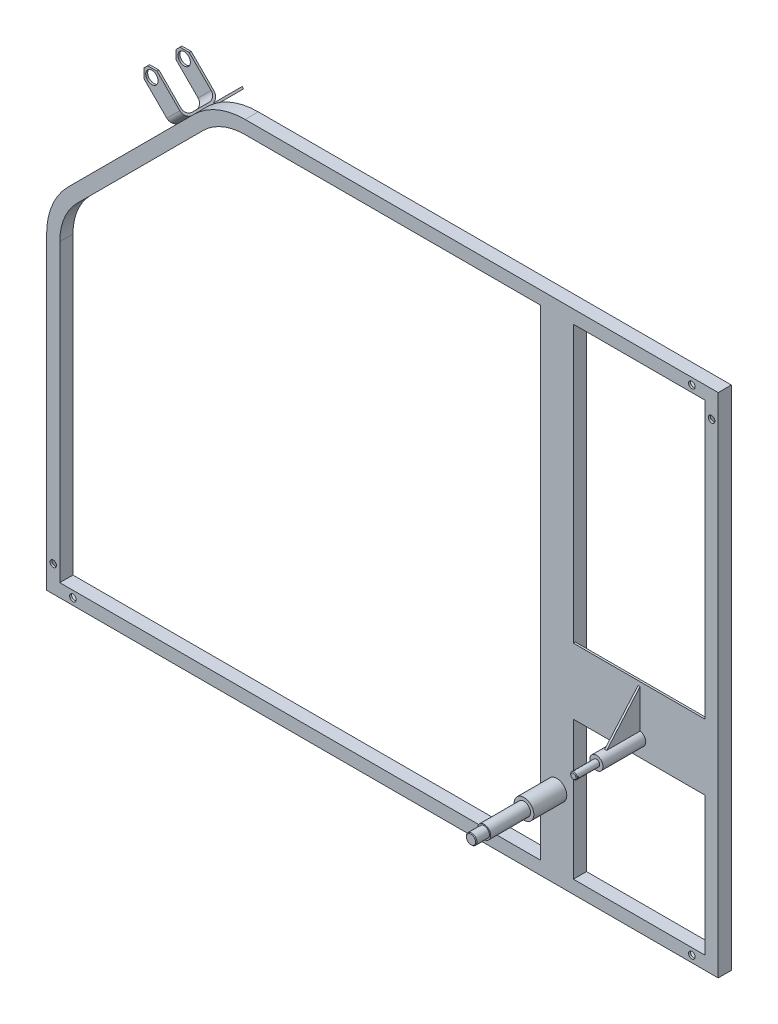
from build123d import *

# Parameters (mm, degrees)
ESQUISSE2_W                  = 20
ESQUISSE2_H                  = 20
ESQUISSE2_W_2                = 14
ESQUISSE2_H_2                = 14
EXTRUSION1_REACH             = 1260.054
ESQUISSE3_W                  = 50
ESQUISSE3_H                  = 20
ESQUISSE3_W_2                = 44
ESQUISSE3_H_2                = 14
EXTRUSION2_REACH             = 1258.065
ESQUISSE4_W                  = 20
ESQUISSE4_H                  = 50
ESQUISSE4_W_2                = 14
ESQUISSE4_H_2                = 44
ESQUISSE5_R                  = 15
EXTRUSION3_DEPTH             = 50
ESQUISSE6_R                  = 10
EXTRUSION4_DEPTH             = 60.5
ESQUISSE7_R                  = 8
EXTRUSION5_DEPTH             = 20
EXTRUSION6_REACH             = 1265.859
ESQUISSE8_W                  = 3
ESQUISSE8_H                  = 50
ESQUISSE9_R                  = 10
EXTRUSION7_DEPTH             = 65
ESQUISSE10_R                 = 5
EXTRUSION8_DEPTH             = 35
EXTRUSION9_DEPTH             = 13
EXTRUSION9_DEPTH_BACK        = 15
CHANFREIN1_SIZE              = 10
ESQUISSE13_R                 = 9.403986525
ENL_V_MAT_EXTRU_1_DEPTH      = 1283.476129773
EXTRUSION10_DEPTH            = 51
ESQUISSE15_R                 = 3.5
ENL_V_MAT_EXTRU_2_DEPTH      = 1091.887932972
NERVURE9_REACH               = 1196.296
ESQUISSE16_WALL_W            = 2490.623643
ESQUISSE16_WALL_H            = 3
ESQUISSE17_R                 = 5
ENL_V_MAT_EXTRU_3_DEPTH      = 1279.300834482
ESQUISSE18_R                 = 4.903594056
ENL_V_MAT_EXTRU_4_DEPTH      = 1281.497178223
CHANFREIN2_SIZE              = 1
CHANFREIN3_SIZE              = 1
ENL_V_MAT_EXTRU_5_DEPTH      = 14
ENL_V_MAT_EXTRU_5_DEPTH_BACK = 14
ESQUISSE19_R                 = 0.75


with BuildPart() as part:
    # Balayage1: sweep along a path in Esquisse1
    with BuildLine(Plane.XY) as balayage1_path:
        Line((0, 0), (-1000, 0))
        Line((-1000, 0), (-1000, 458.578643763))
        ThreePointArc((-1000, 458.578643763), (-992.387953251, 496.846986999), (-970.710678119, 529.289321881))
        Line((-970.710678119, 529.289321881), (-779.289321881, 720.710678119))
        ThreePointArc((-779.289321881, 720.710678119), (-746.846986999, 742.387953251), (-708.578643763, 750))
        Line((-708.578643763, 750), (0, 750))
        Line((0, 750), (0, 0))
    # Esquisse2 → Balayage1 (sweep)
    with BuildSketch(Plane(origin=(0, 0, 0), x_dir=(0, 0, -1), z_dir=(1, 0, 0))):
        Rectangle(ESQUISSE2_W, ESQUISSE2_H)
        Rectangle(ESQUISSE2_W_2, ESQUISSE2_H_2, mode=Mode.SUBTRACT)
    sweep(path=balayage1_path.line, transition=Transition.RIGHT)

    # Esquisse3 → Extrusion1 (add, up to next)
    with BuildSketch(Plane.XZ.offset(-740), mode=Mode.PRIVATE) as extrusion1_sk1:
        with Locations((-235, 0)):
            Rectangle(ESQUISSE3_W, ESQUISSE3_H)
        with Locations((-235, 0)):
            Rectangle(ESQUISSE3_W_2, ESQUISSE3_H_2, mode=Mode.SUBTRACT)
    extrusion1_tool1 = extrude(extrusion1_sk1.sketch, amount=EXTRUSION1_REACH, mode=Mode.PRIVATE) - part.part
    add(extrusion1_tool1.solids().sort_by_distance((-235, 740, 9.461484))[0])

    # Esquisse4 → Extrusion2 (add, up to next)
    with BuildSketch(Plane.ZY.offset(10), mode=Mode.PRIVATE) as extrusion2_sk1:
        with Locations((0, 245.45562568)):
            Rectangle(ESQUISSE4_W, ESQUISSE4_H)
        with Locations((0, 245.45562568)):
            Rectangle(ESQUISSE4_W_2, ESQUISSE4_H_2, mode=Mode.SUBTRACT)
    extrusion2_tool1 = extrude(extrusion2_sk1.sketch, amount=EXTRUSION2_REACH, mode=Mode.PRIVATE) - part.part
    add(extrusion2_tool1.solids().sort_by_distance((-10, 269.917109, 0))[0])

    # Esquisse5 → Extrusion3 (add)
    with BuildSketch(Plane.XY.offset(10)):
        with Locations((-235, 115)):
            Circle(ESQUISSE5_R)
    extrude(amount=EXTRUSION3_DEPTH)

    # Esquisse6 → Extrusion4 (add)
    with BuildSketch(Plane.XY.offset(60)):
        with Locations((-235, 115)):
            Circle(ESQUISSE6_R)
    extrude(amount=EXTRUSION4_DEPTH)

    # Esquisse7 → Extrusion5 (add)
    with BuildSketch(Plane.XY.offset(120.5)):
        with Locations((-235, 115)):
            Circle(ESQUISSE7_R)
    extrude(amount=EXTRUSION5_DEPTH)

    # Esquisse8 → Extrusion6 (add, up to next)
    with BuildSketch(Plane.ZY.offset(10), mode=Mode.PRIVATE) as extrusion6_sk1:
        with Locations((8.5, 295.45562568)):
            Rectangle(ESQUISSE8_W, ESQUISSE8_H)
    extrusion6_tool1 = extrude(extrusion6_sk1.sketch, amount=EXTRUSION6_REACH, mode=Mode.PRIVATE) - part.part
    add(extrusion6_tool1.solids().sort_by_distance((-10, 295.455626, 8.5))[0])

    # Esquisse9 → Extrusion7 (add)
    with BuildSketch(Plane.XY.offset(10)):
        with Locations((-110, 245.45562568)):
            Circle(ESQUISSE9_R)
    extrude(amount=EXTRUSION7_DEPTH)

    # Esquisse10 → Extrusion8 (add)
    with BuildSketch(Plane.XY.offset(75)):
        with Locations((-110, 245.45562568)):
            Circle(ESQUISSE10_R)
    extrude(amount=EXTRUSION8_DEPTH)

    # Esquisse12 → Extrusion9 (add, two sides: drawn at the far end of the back side and taken through both)
    with BuildSketch(Plane(origin=(-36.082088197, -36.082088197, 0), x_dir=(0, 0, -1), z_dir=(0.7071067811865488, 0.7071067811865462, -2.6360787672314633e-15)).offset(-EXTRUSION9_DEPTH_BACK)):
        with BuildLine():
            Line((26, 1140.66017178), (26, 1081.66017178))
            ThreePointArc((26, 1081.66017178), (22.778174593, 1073.881997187), (15, 1070.66017178))
            Line((15, 1070.66017178), (-15, 1070.66017178))
            ThreePointArc((-15, 1070.66017178), (-22.778174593, 1073.881997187), (-26, 1081.66017178))
            Line((-26, 1081.66017178), (-26, 1140.66017178))
            Line((-26, 1140.66017178), (-23, 1140.66017178))
            Line((-23, 1140.66017178), (-23, 1083.66017178))
            ThreePointArc((-23, 1083.66017178), (-20.071067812, 1076.589103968), (-13, 1073.66017178))
            Line((-13, 1073.66017178), (13, 1073.66017178))
            ThreePointArc((13, 1073.66017178), (20.071067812, 1076.589103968), (23, 1083.66017178))
            Line((23, 1083.66017178), (23, 1140.66017178))
            Line((23, 1140.66017178), (26, 1140.66017178))
        make_face()
    extrude(amount=EXTRUSION9_DEPTH + EXTRUSION9_DEPTH_BACK)

    # Chanfrein1
    chanfrein1_edges = [part.edges().sort_by_distance(p)[0] for p in [
        (-853.257232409, 759.879852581, -24.5),
        (-853.257232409, 759.879852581, 24.5),
        (-833.458242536, 779.678842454, -24.5),
        (-833.458242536, 779.678842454, 24.5),
    ]]
    chamfer(chanfrein1_edges, length=CHANFREIN1_SIZE)

    # Esquisse13 → Enl_v. mat.-Extru.1 (cut, through all)
    with BuildSketch(Plane(origin=(0, 0, -26), x_dir=(-1, 0, 0), z_dir=(0, 0, -1))):
        with Locations((834.083899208, 760.466493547)):
            Circle(ESQUISSE13_R)
    extrude(amount=-ENL_V_MAT_EXTRU_1_DEPTH, mode=Mode.SUBTRACT)

    # Esquisse14 → Extrusion10 (add)
    with BuildSketch(Plane(origin=(0, 0, -10), x_dir=(-1, 0, 0), z_dir=(0, 0, -1))):
        Polygon((783.960767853, 730.181367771), (781.839447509, 728.060047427), (801.638437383, 708.261057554), (803.759757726, 710.382377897), align=None)
    extrude(amount=EXTRUSION10_DEPTH)

    # Esquisse15 → Enl_v. mat.-Extru.2 (cut, through all)
    with BuildSketch(Plane(origin=(-754.949747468, 754.949747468, 0), x_dir=(0, 0, -1), z_dir=(0.7071067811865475, -0.7071067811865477, 0))):
        with Locations(Location((41, -51.027778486, 0), (0, 0, 90))):
            Circle(ESQUISSE15_R)
    extrude(amount=-ENL_V_MAT_EXTRU_2_DEPTH, mode=Mode.SUBTRACT)

    # Esquisse16 wall → Nervure9 (add, up to next)
    with BuildSketch(Plane(origin=(-110.1776504, 289.015981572, 31.611392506), x_dir=(0, -0.756370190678, 0.65414381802), z_dir=(0, -0.65414381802, -0.756370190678)), mode=Mode.PRIVATE) as nervure9_sk1:
        Rectangle(ESQUISSE16_WALL_W, ESQUISSE16_WALL_H)
    nervure9_tool1 = extrude(nervure9_sk1.sketch, amount=NERVURE9_REACH, mode=Mode.PRIVATE) - part.part
    add(nervure9_tool1.solids().sort_by_distance((-110.1776504, 289.015981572, 31.611392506))[0])

    # Esquisse17 → Enl_v. mat.-Extru.3 (cut, through all)
    with BuildSketch(Plane.XY.offset(10)):
        with Locations((-30, 750)):
            Circle(ESQUISSE17_R)
        with Locations((-970, 0)):
            Circle(ESQUISSE17_R)
        with Locations((0, 720)):
            Circle(ESQUISSE17_R)
        with Locations((-30, 0)):
            Circle(ESQUISSE17_R)
    extrude(amount=-ENL_V_MAT_EXTRU_3_DEPTH, mode=Mode.SUBTRACT)

    # Esquisse18 → Enl_v. mat.-Extru.4 (cut, through all)
    with BuildSketch(Plane(origin=(0, 0, -10), x_dir=(-1, 0, 0), z_dir=(0, 0, -1))):
        with Locations((1000, 30)):
            Circle(ESQUISSE18_R)
    extrude(amount=-ENL_V_MAT_EXTRU_4_DEPTH, mode=Mode.SUBTRACT)

    # Chanfrein2
    chanfrein2_edges = [part.edges().sort_by_distance(p)[0] for p in [
        (-243, 115, 140.5),
    ]]
    chamfer(chanfrein2_edges, length=CHANFREIN2_SIZE)

    # Chanfrein3
    chanfrein3_edges = [part.edges().sort_by_distance(p)[0] for p in [
        (-115, 245.45562568, 110),
    ]]
    chamfer(chanfrein3_edges, length=CHANFREIN3_SIZE)

    # Esquisse19 → Enl_v. mat.-Extru.5 (cut, two sides: drawn at the far end of the back side and taken through both)
    with BuildSketch(Plane(origin=(-108.6776504, 0, 0), x_dir=(0, 0, -1), z_dir=(1, 0, 0)).offset(-ENL_V_MAT_EXTRU_5_DEPTH_BACK)):
        with Locations((-108, 245.479489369)):
            Circle(ESQUISSE19_R)
    extrude(amount=ENL_V_MAT_EXTRU_5_DEPTH + ENL_V_MAT_EXTRU_5_DEPTH_BACK, mode=Mode.SUBTRACT)


solid = part.part
